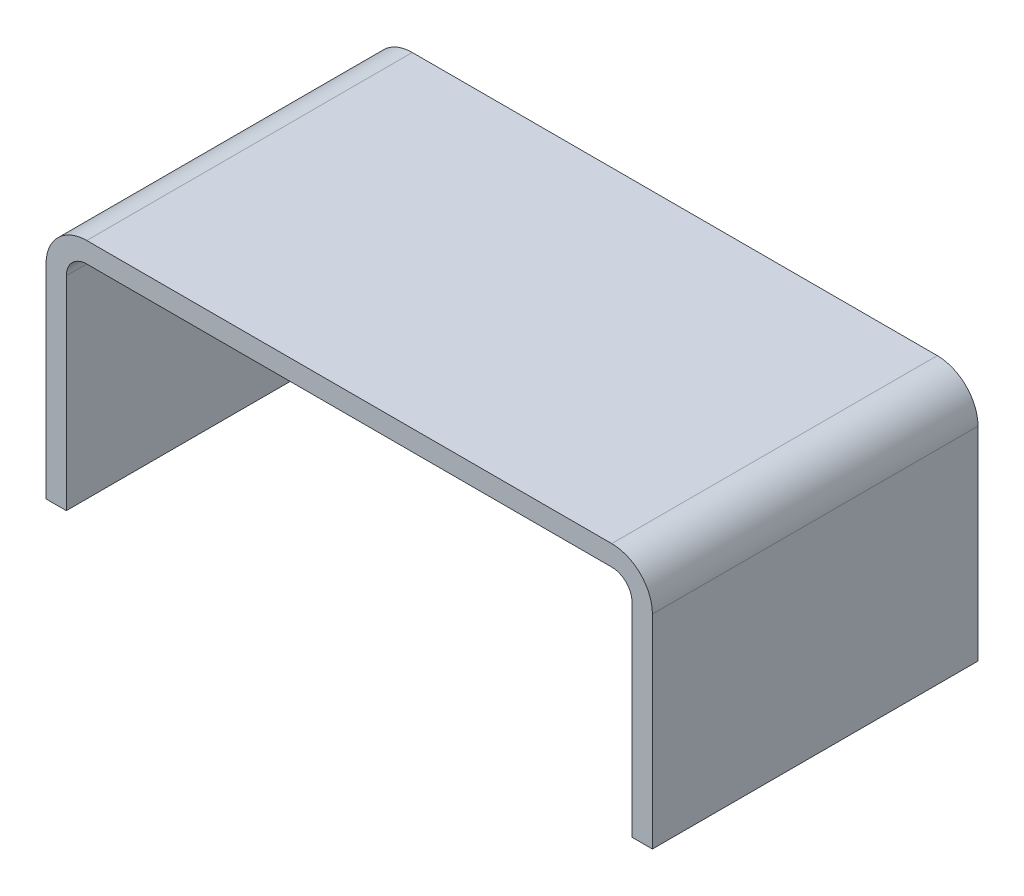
ISO-10303-21;
HEADER;
FILE_DESCRIPTION(('STEP AP214'),'2;1');
FILE_NAME('part.step','',(''),(''),'','','');
FILE_SCHEMA(('AUTOMOTIVE_DESIGN { 1 0 10303 214 1 1 1 1 }'));
ENDSEC;
DATA;
#1=APPLICATION_CONTEXT('core data for automotive mechanical design processes');
#2=APPLICATION_PROTOCOL_DEFINITION('international standard','automotive_design',2000,#1);
#3=PRODUCT_CONTEXT('',#1,'mechanical');
#4=PRODUCT('Part','Part','',(#3));
#5=PRODUCT_RELATED_PRODUCT_CATEGORY('part','',(#4));
#6=PRODUCT_DEFINITION_FORMATION('','',#4);
#7=PRODUCT_DEFINITION_CONTEXT('part definition',#1,'design');
#8=PRODUCT_DEFINITION('design','',#6,#7);
#9=PRODUCT_DEFINITION_SHAPE('','',#8);
#10=(LENGTH_UNIT() NAMED_UNIT(*) SI_UNIT(.MILLI.,.METRE.));
#11=(NAMED_UNIT(*) PLANE_ANGLE_UNIT() SI_UNIT($,.RADIAN.));
#12=(NAMED_UNIT(*) SI_UNIT($,.STERADIAN.) SOLID_ANGLE_UNIT());
#13=UNCERTAINTY_MEASURE_WITH_UNIT(LENGTH_MEASURE(1.E-05),#10,'distance_accuracy_value','');
#14=(GEOMETRIC_REPRESENTATION_CONTEXT(3) GLOBAL_UNCERTAINTY_ASSIGNED_CONTEXT((#13)) GLOBAL_UNIT_ASSIGNED_CONTEXT((#10,
#11,#12)) REPRESENTATION_CONTEXT('',''));
#15=CARTESIAN_POINT('',(0.,0.,0.));
#16=DIRECTION('',(0.,0.,1.));
#17=DIRECTION('',(1.,0.,0.));
#18=AXIS2_PLACEMENT_3D('',#15,#16,#17);
#19=CARTESIAN_POINT('',(0.,0.,1000.));
#20=DIRECTION('',(1.,0.,0.));
#21=DIRECTION('',(0.,0.,-1.));
#22=AXIS2_PLACEMENT_3D('',#19,#20,#21);
#23=PLANE('',#22);
#24=DIRECTION('',(0.,0.,-1.));
#25=VECTOR('',#24,1.);
#26=CARTESIAN_POINT('',(0.,49.9999999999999,1000.));
#27=LINE('',#26,#25);
#28=CARTESIAN_POINT('',(0.,49.9999999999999,1000.));
#29=VERTEX_POINT('',#28);
#30=CARTESIAN_POINT('',(0.,49.9999999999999,920.));
#31=VERTEX_POINT('',#30);
#32=EDGE_CURVE('E131',#29,#31,#27,.T.);
#33=ORIENTED_EDGE('',*,*,#32,.T.);
#34=DIRECTION('',(0.,-1.,0.));
#35=VECTOR('',#34,1.);
#36=CARTESIAN_POINT('',(0.,0.,920.));
#37=LINE('',#36,#35);
#38=CARTESIAN_POINT('',(0.,0.,920.));
#39=VERTEX_POINT('',#38);
#40=EDGE_CURVE('E42',#31,#39,#37,.T.);
#41=ORIENTED_EDGE('',*,*,#40,.T.);
#42=DIRECTION('',(0.,0.,-1.));
#43=VECTOR('',#42,1.);
#44=CARTESIAN_POINT('',(0.,0.,1000.));
#45=LINE('',#44,#43);
#46=CARTESIAN_POINT('',(0.,0.,1000.));
#47=VERTEX_POINT('',#46);
#48=EDGE_CURVE('E35',#47,#39,#45,.T.);
#49=ORIENTED_EDGE('',*,*,#48,.F.);
#50=DIRECTION('',(0.,-1.,0.));
#51=VECTOR('',#50,1.);
#52=CARTESIAN_POINT('',(0.,0.,1000.));
#53=LINE('',#52,#51);
#54=EDGE_CURVE('E170',#29,#47,#53,.T.);
#55=ORIENTED_EDGE('',*,*,#54,.F.);
#56=EDGE_LOOP('',(#33,#41,#49,#55));
#57=FACE_BOUND('',#56,.T.);
#58=ADVANCED_FACE('F28',(#57),#23,.F.);
#59=CARTESIAN_POINT('',(0.,0.,1000.));
#60=DIRECTION('',(0.,1.,0.));
#61=DIRECTION('',(0.,0.,1.));
#62=AXIS2_PLACEMENT_3D('',#59,#60,#61);
#63=PLANE('',#62);
#64=ORIENTED_EDGE('',*,*,#48,.T.);
#65=DIRECTION('',(1.,0.,0.));
#66=VECTOR('',#65,1.);
#67=CARTESIAN_POINT('',(-60.,0.,920.));
#68=LINE('',#67,#66);
#69=CARTESIAN_POINT('',(5.,0.,920.));
#70=VERTEX_POINT('',#69);
#71=EDGE_CURVE('E166',#39,#70,#68,.T.);
#72=ORIENTED_EDGE('',*,*,#71,.T.);
#73=DIRECTION('',(0.,0.,-1.));
#74=VECTOR('',#73,1.);
#75=CARTESIAN_POINT('',(5.,0.,1000.));
#76=LINE('',#75,#74);
#77=CARTESIAN_POINT('',(5.,0.,1000.));
#78=VERTEX_POINT('',#77);
#79=EDGE_CURVE('E158',#78,#70,#76,.T.);
#80=ORIENTED_EDGE('',*,*,#79,.F.);
#81=DIRECTION('',(1.,0.,0.));
#82=VECTOR('',#81,1.);
#83=CARTESIAN_POINT('',(0.,0.,1000.));
#84=LINE('',#83,#82);
#85=EDGE_CURVE('E167',#47,#78,#84,.T.);
#86=ORIENTED_EDGE('',*,*,#85,.F.);
#87=EDGE_LOOP('',(#64,#72,#80,#86));
#88=FACE_BOUND('',#87,.T.);
#89=ADVANCED_FACE('F164',(#88),#63,.F.);
#90=CARTESIAN_POINT('',(5.,0.,1000.));
#91=DIRECTION('',(-1.,0.,0.));
#92=DIRECTION('',(0.,0.,1.));
#93=AXIS2_PLACEMENT_3D('',#90,#91,#92);
#94=PLANE('',#93);
#95=ORIENTED_EDGE('',*,*,#79,.T.);
#96=DIRECTION('',(0.,1.,0.));
#97=VECTOR('',#96,1.);
#98=CARTESIAN_POINT('',(5.,0.,920.));
#99=LINE('',#98,#97);
#100=CARTESIAN_POINT('',(5.,50.,920.));
#101=VERTEX_POINT('',#100);
#102=EDGE_CURVE('E191',#70,#101,#99,.T.);
#103=ORIENTED_EDGE('',*,*,#102,.T.);
#104=DIRECTION('',(0.,0.,-1.));
#105=VECTOR('',#104,1.);
#106=CARTESIAN_POINT('',(5.,50.,1000.));
#107=LINE('',#106,#105);
#108=CARTESIAN_POINT('',(5.,50.,1000.));
#109=VERTEX_POINT('',#108);
#110=EDGE_CURVE('E155',#109,#101,#107,.T.);
#111=ORIENTED_EDGE('',*,*,#110,.F.);
#112=DIRECTION('',(0.,1.,0.));
#113=VECTOR('',#112,1.);
#114=CARTESIAN_POINT('',(5.,0.,1000.));
#115=LINE('',#114,#113);
#116=EDGE_CURVE('E196',#78,#109,#115,.T.);
#117=ORIENTED_EDGE('',*,*,#116,.F.);
#118=EDGE_LOOP('',(#95,#103,#111,#117));
#119=FACE_BOUND('',#118,.T.);
#120=ADVANCED_FACE('F244',(#119),#94,.F.);
#121=CARTESIAN_POINT('',(10.,50.,1000.));
#122=DIRECTION('',(0.,0.,-1.));
#123=DIRECTION('',(-1.,0.,0.));
#124=AXIS2_PLACEMENT_3D('',#121,#122,#123);
#125=CYLINDRICAL_SURFACE('',#124,5.);
#126=ORIENTED_EDGE('',*,*,#110,.T.);
#127=CARTESIAN_POINT('',(10.,50.,920.));
#128=DIRECTION('',(0.,0.,1.));
#129=DIRECTION('',(1.,0.,0.));
#130=AXIS2_PLACEMENT_3D('',#127,#128,#129);
#131=CIRCLE('',#130,5.);
#132=CARTESIAN_POINT('',(10.,55.,920.));
#133=VERTEX_POINT('',#132);
#134=EDGE_CURVE('E188',#101,#133,#131,.F.);
#135=ORIENTED_EDGE('',*,*,#134,.T.);
#136=DIRECTION('',(0.,0.,-1.));
#137=VECTOR('',#136,1.);
#138=CARTESIAN_POINT('',(10.,55.,1000.));
#139=LINE('',#138,#137);
#140=CARTESIAN_POINT('',(10.,55.,1000.));
#141=VERTEX_POINT('',#140);
#142=EDGE_CURVE('E152',#141,#133,#139,.T.);
#143=ORIENTED_EDGE('',*,*,#142,.F.);
#144=CARTESIAN_POINT('',(10.,50.,1000.));
#145=DIRECTION('',(0.,0.,-1.));
#146=DIRECTION('',(-1.,0.,0.));
#147=AXIS2_PLACEMENT_3D('',#144,#145,#146);
#148=CIRCLE('',#147,5.);
#149=EDGE_CURVE('E198',#109,#141,#148,.T.);
#150=ORIENTED_EDGE('',*,*,#149,.F.);
#151=EDGE_LOOP('',(#126,#135,#143,#150));
#152=FACE_BOUND('',#151,.T.);
#153=ADVANCED_FACE('F241',(#152),#125,.F.);
#154=CARTESIAN_POINT('',(10.,55.,1000.));
#155=DIRECTION('',(0.,1.,0.));
#156=DIRECTION('',(0.,0.,1.));
#157=AXIS2_PLACEMENT_3D('',#154,#155,#156);
#158=PLANE('',#157);
#159=ORIENTED_EDGE('',*,*,#142,.T.);
#160=DIRECTION('',(1.,0.,0.));
#161=VECTOR('',#160,1.);
#162=CARTESIAN_POINT('',(10.,55.,920.));
#163=LINE('',#162,#161);
#164=CARTESIAN_POINT('',(139.,55.,920.));
#165=VERTEX_POINT('',#164);
#166=EDGE_CURVE('E185',#133,#165,#163,.T.);
#167=ORIENTED_EDGE('',*,*,#166,.T.);
#168=DIRECTION('',(0.,0.,-1.));
#169=VECTOR('',#168,1.);
#170=CARTESIAN_POINT('',(139.,55.,1000.));
#171=LINE('',#170,#169);
#172=CARTESIAN_POINT('',(139.,55.,1000.));
#173=VERTEX_POINT('',#172);
#174=EDGE_CURVE('E149',#173,#165,#171,.T.);
#175=ORIENTED_EDGE('',*,*,#174,.F.);
#176=DIRECTION('',(1.,0.,0.));
#177=VECTOR('',#176,1.);
#178=CARTESIAN_POINT('',(10.,55.,1000.));
#179=LINE('',#178,#177);
#180=EDGE_CURVE('E200',#141,#173,#179,.T.);
#181=ORIENTED_EDGE('',*,*,#180,.F.);
#182=EDGE_LOOP('',(#159,#167,#175,#181));
#183=FACE_BOUND('',#182,.T.);
#184=ADVANCED_FACE('F236',(#183),#158,.F.);
#185=CARTESIAN_POINT('',(139.,50.,1000.));
#186=DIRECTION('',(0.,0.,-1.));
#187=DIRECTION('',(-1.,0.,0.));
#188=AXIS2_PLACEMENT_3D('',#185,#186,#187);
#189=CYLINDRICAL_SURFACE('',#188,5.);
#190=ORIENTED_EDGE('',*,*,#174,.T.);
#191=CARTESIAN_POINT('',(139.,50.,920.));
#192=DIRECTION('',(0.,0.,1.));
#193=DIRECTION('',(1.,0.,0.));
#194=AXIS2_PLACEMENT_3D('',#191,#192,#193);
#195=CIRCLE('',#194,5.);
#196=CARTESIAN_POINT('',(144.,50.,920.));
#197=VERTEX_POINT('',#196);
#198=EDGE_CURVE('E182',#165,#197,#195,.F.);
#199=ORIENTED_EDGE('',*,*,#198,.T.);
#200=DIRECTION('',(0.,0.,-1.));
#201=VECTOR('',#200,1.);
#202=CARTESIAN_POINT('',(144.,50.,1000.));
#203=LINE('',#202,#201);
#204=CARTESIAN_POINT('',(144.,50.,1000.));
#205=VERTEX_POINT('',#204);
#206=EDGE_CURVE('E146',#205,#197,#203,.T.);
#207=ORIENTED_EDGE('',*,*,#206,.F.);
#208=CARTESIAN_POINT('',(139.,50.,1000.));
#209=DIRECTION('',(0.,0.,-1.));
#210=DIRECTION('',(-1.,0.,0.));
#211=AXIS2_PLACEMENT_3D('',#208,#209,#210);
#212=CIRCLE('',#211,5.);
#213=EDGE_CURVE('E202',#173,#205,#212,.T.);
#214=ORIENTED_EDGE('',*,*,#213,.F.);
#215=EDGE_LOOP('',(#190,#199,#207,#214));
#216=FACE_BOUND('',#215,.T.);
#217=ADVANCED_FACE('F233',(#216),#189,.F.);
#218=CARTESIAN_POINT('',(144.,0.,1000.));
#219=DIRECTION('',(1.,0.,0.));
#220=DIRECTION('',(0.,0.,-1.));
#221=AXIS2_PLACEMENT_3D('',#218,#219,#220);
#222=PLANE('',#221);
#223=ORIENTED_EDGE('',*,*,#206,.T.);
#224=DIRECTION('',(0.,-1.,0.));
#225=VECTOR('',#224,1.);
#226=CARTESIAN_POINT('',(144.,0.,920.));
#227=LINE('',#226,#225);
#228=CARTESIAN_POINT('',(144.,0.,920.));
#229=VERTEX_POINT('',#228);
#230=EDGE_CURVE('E179',#197,#229,#227,.T.);
#231=ORIENTED_EDGE('',*,*,#230,.T.);
#232=DIRECTION('',(0.,0.,-1.));
#233=VECTOR('',#232,1.);
#234=CARTESIAN_POINT('',(144.,0.,1000.));
#235=LINE('',#234,#233);
#236=CARTESIAN_POINT('',(144.,0.,1000.));
#237=VERTEX_POINT('',#236);
#238=EDGE_CURVE('E143',#237,#229,#235,.T.);
#239=ORIENTED_EDGE('',*,*,#238,.F.);
#240=DIRECTION('',(0.,-1.,0.));
#241=VECTOR('',#240,1.);
#242=CARTESIAN_POINT('',(144.,0.,1000.));
#243=LINE('',#242,#241);
#244=EDGE_CURVE('E204',#205,#237,#243,.T.);
#245=ORIENTED_EDGE('',*,*,#244,.F.);
#246=EDGE_LOOP('',(#223,#231,#239,#245));
#247=FACE_BOUND('',#246,.T.);
#248=ADVANCED_FACE('F228',(#247),#222,.F.);
#249=CARTESIAN_POINT('',(144.,0.,1000.));
#250=DIRECTION('',(0.,1.,0.));
#251=DIRECTION('',(0.,0.,1.));
#252=AXIS2_PLACEMENT_3D('',#249,#250,#251);
#253=PLANE('',#252);
#254=ORIENTED_EDGE('',*,*,#238,.T.);
#255=CARTESIAN_POINT('',(149.,0.,920.));
#256=VERTEX_POINT('',#255);
#257=EDGE_CURVE('E128',#229,#256,#68,.T.);
#258=ORIENTED_EDGE('',*,*,#257,.T.);
#259=DIRECTION('',(0.,0.,-1.));
#260=VECTOR('',#259,1.);
#261=CARTESIAN_POINT('',(149.,0.,1000.));
#262=LINE('',#261,#260);
#263=CARTESIAN_POINT('',(149.,0.,1000.));
#264=VERTEX_POINT('',#263);
#265=EDGE_CURVE('E140',#264,#256,#262,.T.);
#266=ORIENTED_EDGE('',*,*,#265,.F.);
#267=DIRECTION('',(1.,0.,0.));
#268=VECTOR('',#267,1.);
#269=CARTESIAN_POINT('',(144.,0.,1000.));
#270=LINE('',#269,#268);
#271=EDGE_CURVE('E206',#237,#264,#270,.T.);
#272=ORIENTED_EDGE('',*,*,#271,.F.);
#273=EDGE_LOOP('',(#254,#258,#266,#272));
#274=FACE_BOUND('',#273,.T.);
#275=ADVANCED_FACE('F225',(#274),#253,.F.);
#276=CARTESIAN_POINT('',(149.,0.,1000.));
#277=DIRECTION('',(-1.,0.,0.));
#278=DIRECTION('',(0.,0.,1.));
#279=AXIS2_PLACEMENT_3D('',#276,#277,#278);
#280=PLANE('',#279);
#281=ORIENTED_EDGE('',*,*,#265,.T.);
#282=DIRECTION('',(0.,1.,0.));
#283=VECTOR('',#282,1.);
#284=CARTESIAN_POINT('',(149.,0.,920.));
#285=LINE('',#284,#283);
#286=CARTESIAN_POINT('',(149.,50.,920.));
#287=VERTEX_POINT('',#286);
#288=EDGE_CURVE('E173',#256,#287,#285,.T.);
#289=ORIENTED_EDGE('',*,*,#288,.T.);
#290=DIRECTION('',(0.,0.,-1.));
#291=VECTOR('',#290,1.);
#292=CARTESIAN_POINT('',(149.,49.9999999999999,1000.));
#293=LINE('',#292,#291);
#294=CARTESIAN_POINT('',(149.,49.9999999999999,1000.));
#295=VERTEX_POINT('',#294);
#296=EDGE_CURVE('E133',#295,#287,#293,.T.);
#297=ORIENTED_EDGE('',*,*,#296,.F.);
#298=DIRECTION('',(0.,1.,0.));
#299=VECTOR('',#298,1.);
#300=CARTESIAN_POINT('',(149.,0.,1000.));
#301=LINE('',#300,#299);
#302=EDGE_CURVE('E208',#264,#295,#301,.T.);
#303=ORIENTED_EDGE('',*,*,#302,.F.);
#304=EDGE_LOOP('',(#281,#289,#297,#303));
#305=FACE_BOUND('',#304,.T.);
#306=ADVANCED_FACE('F221',(#305),#280,.F.);
#307=CARTESIAN_POINT('',(139.,50.,1000.));
#308=DIRECTION('',(0.,0.,-1.));
#309=DIRECTION('',(-1.,0.,0.));
#310=AXIS2_PLACEMENT_3D('',#307,#308,#309);
#311=CYLINDRICAL_SURFACE('',#310,10.);
#312=ORIENTED_EDGE('',*,*,#296,.T.);
#313=CARTESIAN_POINT('',(139.,50.,920.));
#314=DIRECTION('',(0.,0.,1.));
#315=DIRECTION('',(1.,0.,0.));
#316=AXIS2_PLACEMENT_3D('',#313,#314,#315);
#317=CIRCLE('',#316,10.);
#318=CARTESIAN_POINT('',(139.,60.,920.));
#319=VERTEX_POINT('',#318);
#320=EDGE_CURVE('E171',#287,#319,#317,.T.);
#321=ORIENTED_EDGE('',*,*,#320,.T.);
#322=DIRECTION('',(0.,0.,-1.));
#323=VECTOR('',#322,1.);
#324=CARTESIAN_POINT('',(139.,60.,1000.));
#325=LINE('',#324,#323);
#326=CARTESIAN_POINT('',(139.,60.,1000.));
#327=VERTEX_POINT('',#326);
#328=EDGE_CURVE('E127',#327,#319,#325,.T.);
#329=ORIENTED_EDGE('',*,*,#328,.F.);
#330=CARTESIAN_POINT('',(139.,50.,1000.));
#331=DIRECTION('',(0.,0.,1.));
#332=DIRECTION('',(-1.,0.,0.));
#333=AXIS2_PLACEMENT_3D('',#330,#331,#332);
#334=CIRCLE('',#333,10.);
#335=EDGE_CURVE('E210',#295,#327,#334,.T.);
#336=ORIENTED_EDGE('',*,*,#335,.F.);
#337=EDGE_LOOP('',(#312,#321,#329,#336));
#338=FACE_BOUND('',#337,.T.);
#339=ADVANCED_FACE('F218',(#338),#311,.T.);
#340=CARTESIAN_POINT('',(10.0000000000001,60.,1000.));
#341=DIRECTION('',(0.,-1.,0.));
#342=DIRECTION('',(0.,0.,-1.));
#343=AXIS2_PLACEMENT_3D('',#340,#341,#342);
#344=PLANE('',#343);
#345=ORIENTED_EDGE('',*,*,#328,.T.);
#346=DIRECTION('',(1.,0.,0.));
#347=VECTOR('',#346,1.);
#348=CARTESIAN_POINT('',(-60.,60.,920.));
#349=LINE('',#348,#347);
#350=CARTESIAN_POINT('',(10.,60.,920.));
#351=VERTEX_POINT('',#350);
#352=EDGE_CURVE('E115',#351,#319,#349,.T.);
#353=ORIENTED_EDGE('',*,*,#352,.F.);
#354=DIRECTION('',(0.,0.,-1.));
#355=VECTOR('',#354,1.);
#356=CARTESIAN_POINT('',(10.0000000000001,60.,1000.));
#357=LINE('',#356,#355);
#358=CARTESIAN_POINT('',(10.0000000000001,60.,1000.));
#359=VERTEX_POINT('',#358);
#360=EDGE_CURVE('E125',#359,#351,#357,.T.);
#361=ORIENTED_EDGE('',*,*,#360,.F.);
#362=DIRECTION('',(-1.,0.,0.));
#363=VECTOR('',#362,1.);
#364=CARTESIAN_POINT('',(10.0000000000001,60.,1000.));
#365=LINE('',#364,#363);
#366=EDGE_CURVE('E212',#327,#359,#365,.T.);
#367=ORIENTED_EDGE('',*,*,#366,.F.);
#368=EDGE_LOOP('',(#345,#353,#361,#367));
#369=FACE_BOUND('',#368,.T.);
#370=ADVANCED_FACE('F123',(#369),#344,.F.);
#371=CARTESIAN_POINT('',(10.,50.,1000.));
#372=DIRECTION('',(0.,0.,-1.));
#373=DIRECTION('',(-1.,0.,0.));
#374=AXIS2_PLACEMENT_3D('',#371,#372,#373);
#375=CYLINDRICAL_SURFACE('',#374,10.);
#376=ORIENTED_EDGE('',*,*,#360,.T.);
#377=CARTESIAN_POINT('',(10.,50.,920.));
#378=DIRECTION('',(0.,0.,1.));
#379=DIRECTION('',(1.,0.,0.));
#380=AXIS2_PLACEMENT_3D('',#377,#378,#379);
#381=CIRCLE('',#380,10.);
#382=EDGE_CURVE('E11',#351,#31,#381,.T.);
#383=ORIENTED_EDGE('',*,*,#382,.T.);
#384=ORIENTED_EDGE('',*,*,#32,.F.);
#385=CARTESIAN_POINT('',(10.,50.,1000.));
#386=DIRECTION('',(0.,0.,1.));
#387=DIRECTION('',(-1.,0.,0.));
#388=AXIS2_PLACEMENT_3D('',#385,#386,#387);
#389=CIRCLE('',#388,10.);
#390=EDGE_CURVE('E49',#359,#29,#389,.T.);
#391=ORIENTED_EDGE('',*,*,#390,.F.);
#392=EDGE_LOOP('',(#376,#383,#384,#391));
#393=FACE_BOUND('',#392,.T.);
#394=ADVANCED_FACE('F130',(#393),#375,.T.);
#395=CARTESIAN_POINT('',(10.,50.,1000.));
#396=DIRECTION('',(0.,0.,-1.));
#397=DIRECTION('',(-1.,0.,0.));
#398=AXIS2_PLACEMENT_3D('',#395,#396,#397);
#399=PLANE('',#398);
#400=ORIENTED_EDGE('',*,*,#54,.T.);
#401=ORIENTED_EDGE('',*,*,#85,.T.);
#402=ORIENTED_EDGE('',*,*,#116,.T.);
#403=ORIENTED_EDGE('',*,*,#149,.T.);
#404=ORIENTED_EDGE('',*,*,#180,.T.);
#405=ORIENTED_EDGE('',*,*,#213,.T.);
#406=ORIENTED_EDGE('',*,*,#244,.T.);
#407=ORIENTED_EDGE('',*,*,#271,.T.);
#408=ORIENTED_EDGE('',*,*,#302,.T.);
#409=ORIENTED_EDGE('',*,*,#335,.T.);
#410=ORIENTED_EDGE('',*,*,#366,.T.);
#411=ORIENTED_EDGE('',*,*,#390,.T.);
#412=EDGE_LOOP('',(#400,#401,#402,#403,#404,#405,#406,#407,#408,#409,#410,#411));
#413=FACE_BOUND('',#412,.T.);
#414=ADVANCED_FACE('F213',(#413),#399,.F.);
#415=CARTESIAN_POINT('',(-60.,0.,920.));
#416=DIRECTION('',(0.,0.,1.));
#417=DIRECTION('',(1.,0.,0.));
#418=AXIS2_PLACEMENT_3D('',#415,#416,#417);
#419=PLANE('',#418);
#420=ORIENTED_EDGE('',*,*,#71,.F.);
#421=ORIENTED_EDGE('',*,*,#40,.F.);
#422=ORIENTED_EDGE('',*,*,#382,.F.);
#423=ORIENTED_EDGE('',*,*,#352,.T.);
#424=ORIENTED_EDGE('',*,*,#320,.F.);
#425=ORIENTED_EDGE('',*,*,#288,.F.);
#426=ORIENTED_EDGE('',*,*,#257,.F.);
#427=ORIENTED_EDGE('',*,*,#230,.F.);
#428=ORIENTED_EDGE('',*,*,#198,.F.);
#429=ORIENTED_EDGE('',*,*,#166,.F.);
#430=ORIENTED_EDGE('',*,*,#134,.F.);
#431=ORIENTED_EDGE('',*,*,#102,.F.);
#432=EDGE_LOOP('',(#420,#421,#422,#423,#424,#425,#426,#427,#428,#429,#430,#431));
#433=FACE_BOUND('',#432,.T.);
#434=ADVANCED_FACE('F114',(#433),#419,.F.);
#435=CLOSED_SHELL('',(#58,#89,#120,#153,#184,#217,#248,#275,#306,#339,#370,#394,#414,#434));
#436=MANIFOLD_SOLID_BREP('B2',#435);
#437=ADVANCED_BREP_SHAPE_REPRESENTATION('',(#18,#436),#14);
#438=SHAPE_DEFINITION_REPRESENTATION(#9,#437);
ENDSEC;
END-ISO-10303-21;
